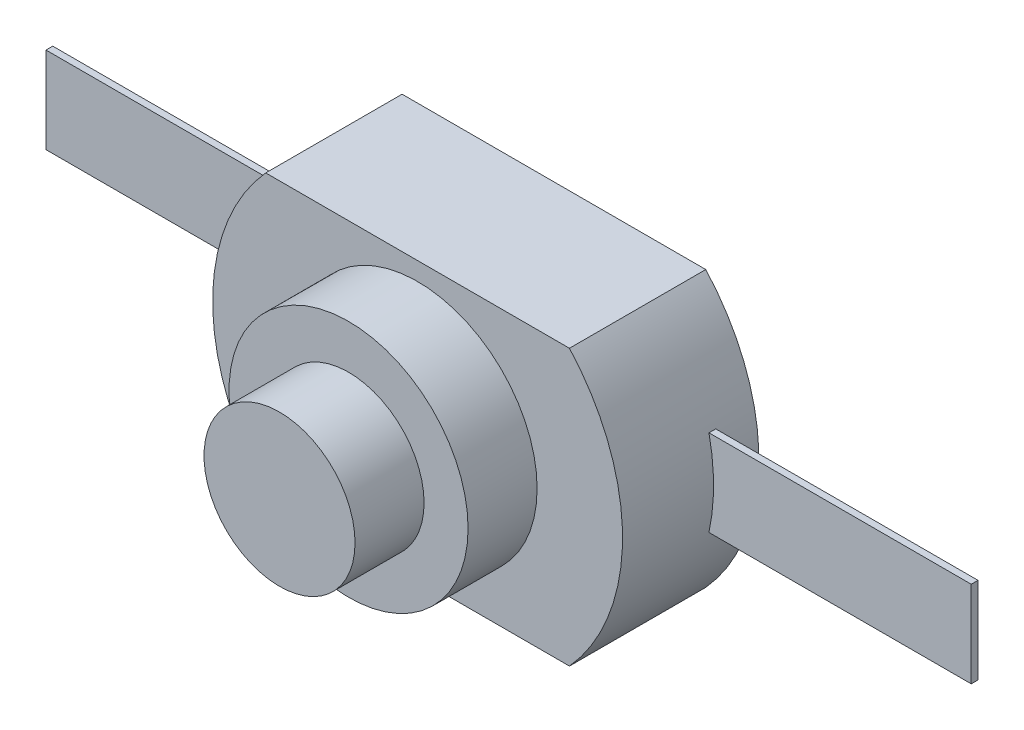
from build123d import *

# Parameters (mm, degrees)
BOSS_EXTRUDE1_DEPTH = 4.0132
SKETCH2_R           = 3.5179
BOSS_EXTRUDE2_DEPTH = 2.032
SKETCH3_R           = 2.2225
BOSS_EXTRUDE3_DEPTH = 2.032
SKETCH4_W           = 27.233789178
SKETCH4_H           = 0.19922478
BOSS_EXTRUDE4_DEPTH = 1.27


with BuildPart() as part:
    # Sketch1 → Boss-Extrude1 (new body)
    with BuildSketch(Plane.XY):
        with BuildLine():
            Line((-4.469678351, -4.0513), (4.469678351, -4.0513))
            ThreePointArc((4.469678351, -4.0513), (6.0325, 0), (4.469678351, 4.0513))
            Line((4.469678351, 4.0513), (-4.469678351, 4.0513))
            ThreePointArc((-4.469678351, 4.0513), (-6.0325, 0), (-4.469678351, -4.0513))
        make_face()
    extrude(amount=BOSS_EXTRUDE1_DEPTH)

    # Sketch2 → Boss-Extrude2 (add)
    with BuildSketch(Plane.XY.offset(4.0132)):
        Circle(SKETCH2_R)
    extrude(amount=BOSS_EXTRUDE2_DEPTH)

    # Sketch3 → Boss-Extrude3 (add)
    with BuildSketch(Plane.XY.offset(6.0452)):
        Circle(SKETCH3_R)
    extrude(amount=BOSS_EXTRUDE3_DEPTH)

    # Sketch4 → Boss-Extrude4 (add, symmetric)
    with BuildSketch(Plane(origin=(0, 0, 0), x_dir=(1, 0, 0), z_dir=(0, 1, 0))):
        with Locations((0, -1.234615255)):
            Rectangle(SKETCH4_W, SKETCH4_H)
    extrude(amount=BOSS_EXTRUDE4_DEPTH, both=True)


solid = part.part
